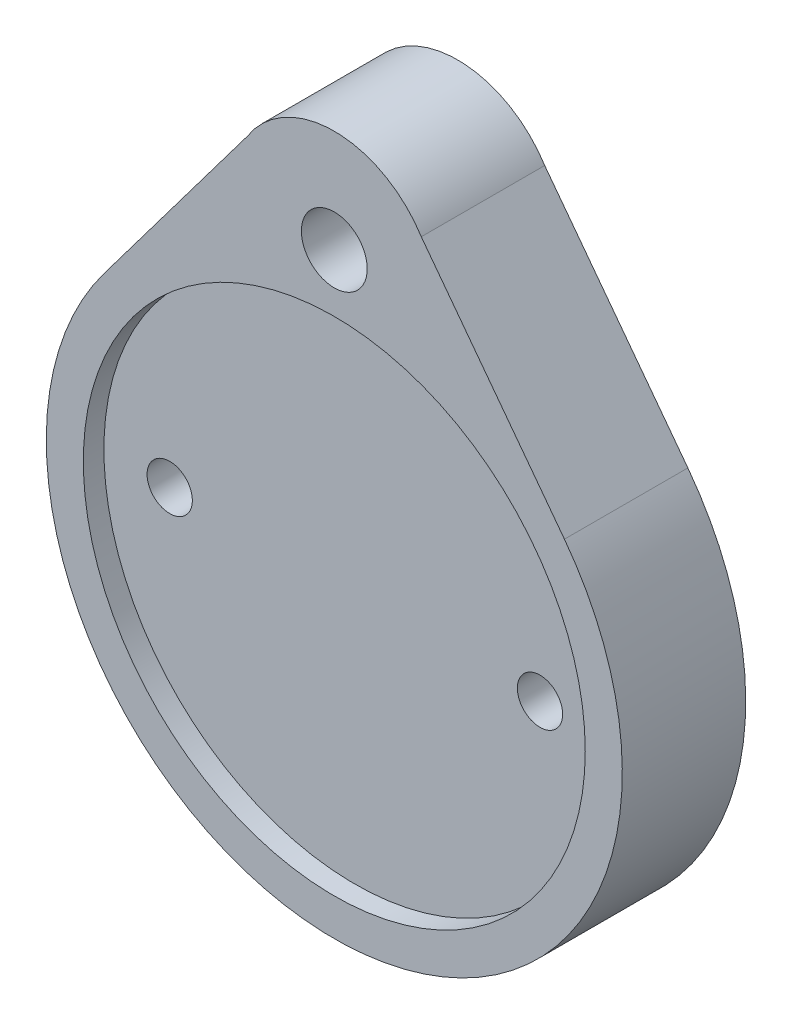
from build123d import *

# Parameters (mm, degrees)
ESQUISSE1_R             = 1.6
BOSS_EXTRU_1_DEPTH      = 6
ESQUISSE2_R             = 12.2
ENL_V_MAT_EXTRU_1_DEPTH = 1
ESQUISSE3_R             = 1.1
ENL_V_MAT_EXTRU_2_DEPTH = 2


with BuildPart() as part:
    # Esquisse1 → Boss.-Extru.1 (new body)
    with BuildSketch(Plane.XY):
        with BuildLine():
            Line((-4.229525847, 17.666666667), (-11.188113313, 8.415825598))
            ThreePointArc((-11.188113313, 8.415825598), (0, -14), (11.188113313, 8.415825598))
            Line((11.188113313, 8.415825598), (4.229525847, 17.666666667))
            ThreePointArc((4.229525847, 17.666666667), (0, 20), (-4.229525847, 17.666666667))
        make_face()
        with Locations((0, 15)):
            Circle(ESQUISSE1_R, mode=Mode.SUBTRACT)
    extrude(amount=BOSS_EXTRU_1_DEPTH)

    # Esquisse2 → Enl_v. mat.-Extru.1 (cut)
    with BuildSketch(Plane.XY.offset(6)):
        Circle(ESQUISSE2_R)
    extrude(amount=-ENL_V_MAT_EXTRU_1_DEPTH, mode=Mode.SUBTRACT)

    # Esquisse3 → Enl_v. mat.-Extru.2 (cut)
    with BuildSketch(Plane.XY.offset(5)):
        with Locations((9, 0)):
            Circle(ESQUISSE3_R)
        with Locations(Location((-9, 0, 0), (0, 0, 180))):
            Circle(ESQUISSE3_R)
    extrude(amount=-ENL_V_MAT_EXTRU_2_DEPTH, mode=Mode.SUBTRACT)


solid = part.part
